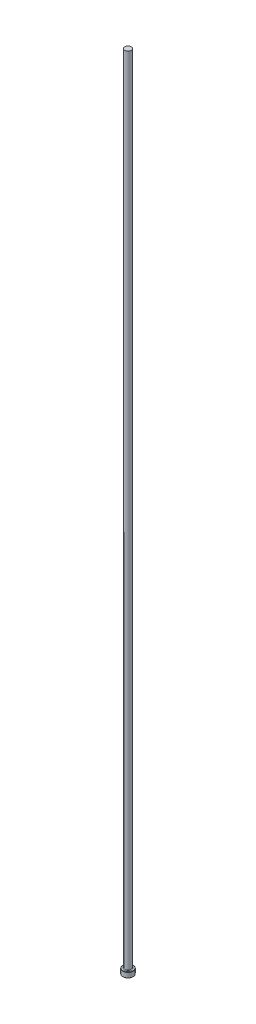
ISO-10303-21;
HEADER;
FILE_DESCRIPTION(('STEP AP214'),'2;1');
FILE_NAME('part.step','',(''),(''),'','','');
FILE_SCHEMA(('AUTOMOTIVE_DESIGN { 1 0 10303 214 1 1 1 1 }'));
ENDSEC;
DATA;
#1=APPLICATION_CONTEXT('core data for automotive mechanical design processes');
#2=APPLICATION_PROTOCOL_DEFINITION('international standard','automotive_design',2000,#1);
#3=PRODUCT_CONTEXT('',#1,'mechanical');
#4=PRODUCT('Part','Part','',(#3));
#5=PRODUCT_RELATED_PRODUCT_CATEGORY('part','',(#4));
#6=PRODUCT_DEFINITION_FORMATION('','',#4);
#7=PRODUCT_DEFINITION_CONTEXT('part definition',#1,'design');
#8=PRODUCT_DEFINITION('design','',#6,#7);
#9=PRODUCT_DEFINITION_SHAPE('','',#8);
#10=(LENGTH_UNIT() NAMED_UNIT(*) SI_UNIT(.MILLI.,.METRE.));
#11=(NAMED_UNIT(*) PLANE_ANGLE_UNIT() SI_UNIT($,.RADIAN.));
#12=(NAMED_UNIT(*) SI_UNIT($,.STERADIAN.) SOLID_ANGLE_UNIT());
#13=UNCERTAINTY_MEASURE_WITH_UNIT(LENGTH_MEASURE(1.E-05),#10,'distance_accuracy_value','');
#14=(GEOMETRIC_REPRESENTATION_CONTEXT(3) GLOBAL_UNCERTAINTY_ASSIGNED_CONTEXT((#13)) GLOBAL_UNIT_ASSIGNED_CONTEXT((#10,
#11,#12)) REPRESENTATION_CONTEXT('',''));
#15=CARTESIAN_POINT('',(0.,0.,0.));
#16=DIRECTION('',(0.,0.,1.));
#17=DIRECTION('',(1.,0.,0.));
#18=AXIS2_PLACEMENT_3D('',#15,#16,#17);
#19=CARTESIAN_POINT('',(0.,0.,0.));
#20=DIRECTION('',(0.,-1.,0.));
#21=DIRECTION('',(0.,0.,-1.));
#22=AXIS2_PLACEMENT_3D('',#19,#20,#21);
#23=PLANE('',#22);
#24=CARTESIAN_POINT('',(0.,0.,0.));
#25=DIRECTION('',(0.,-1.,0.));
#26=DIRECTION('',(0.,0.,-1.));
#27=AXIS2_PLACEMENT_3D('',#24,#25,#26);
#28=CIRCLE('',#27,6.09599999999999);
#29=CARTESIAN_POINT('',(0.,0.,-6.09599999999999));
#30=VERTEX_POINT('',#29);
#31=EDGE_CURVE('E41',#30,#30,#28,.T.);
#32=ORIENTED_EDGE('',*,*,#31,.T.);
#33=EDGE_LOOP('',(#32));
#34=FACE_BOUND('',#33,.T.);
#35=ADVANCED_FACE('F30',(#34),#23,.T.);
#36=CARTESIAN_POINT('',(0.,259.958771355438,0.));
#37=DIRECTION('',(0.,1.,0.));
#38=DIRECTION('',(0.,0.,1.));
#39=AXIS2_PLACEMENT_3D('',#36,#37,#38);
#40=CYLINDRICAL_SURFACE('',#39,6.34999999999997);
#41=CARTESIAN_POINT('',(0.,6.09599999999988,0.));
#42=DIRECTION('',(0.,1.,0.));
#43=DIRECTION('',(0.,0.,1.));
#44=AXIS2_PLACEMENT_3D('',#41,#42,#43);
#45=CIRCLE('',#44,6.34999999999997);
#46=CARTESIAN_POINT('',(0.,6.09599999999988,6.34999999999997));
#47=VERTEX_POINT('',#46);
#48=EDGE_CURVE('E45',#47,#47,#45,.F.);
#49=ORIENTED_EDGE('',*,*,#48,.T.);
#50=EDGE_LOOP('',(#49));
#51=FACE_BOUND('',#50,.T.);
#52=CARTESIAN_POINT('',(0.,0.253999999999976,0.));
#53=DIRECTION('',(0.,-1.,0.));
#54=DIRECTION('',(0.,0.,-1.));
#55=AXIS2_PLACEMENT_3D('',#52,#53,#54);
#56=CIRCLE('',#55,6.34999999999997);
#57=CARTESIAN_POINT('',(0.,0.253999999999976,-6.34999999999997));
#58=VERTEX_POINT('',#57);
#59=EDGE_CURVE('E50',#58,#58,#56,.F.);
#60=ORIENTED_EDGE('',*,*,#59,.T.);
#61=EDGE_LOOP('',(#60));
#62=FACE_BOUND('',#61,.T.);
#63=ADVANCED_FACE('F72',(#51,#62),#40,.T.);
#64=CARTESIAN_POINT('',(-6.34999999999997,6.35,0.));
#65=DIRECTION('',(0.,1.,0.));
#66=DIRECTION('',(0.,0.,1.));
#67=AXIS2_PLACEMENT_3D('',#64,#65,#66);
#68=PLANE('',#67);
#69=CARTESIAN_POINT('',(0.,6.35,0.));
#70=DIRECTION('',(0.,1.,0.));
#71=DIRECTION('',(0.,0.,1.));
#72=AXIS2_PLACEMENT_3D('',#69,#70,#71);
#73=CIRCLE('',#72,4.73074999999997);
#74=CARTESIAN_POINT('',(0.,6.35,4.73074999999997));
#75=VERTEX_POINT('',#74);
#76=EDGE_CURVE('E10',#75,#75,#73,.F.);
#77=ORIENTED_EDGE('',*,*,#76,.T.);
#78=EDGE_LOOP('',(#77));
#79=FACE_BOUND('',#78,.T.);
#80=CARTESIAN_POINT('',(0.,6.35,0.));
#81=DIRECTION('',(0.,1.,0.));
#82=DIRECTION('',(0.,0.,1.));
#83=AXIS2_PLACEMENT_3D('',#80,#81,#82);
#84=CIRCLE('',#83,6.0959999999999);
#85=CARTESIAN_POINT('',(0.,6.35,6.0959999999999));
#86=VERTEX_POINT('',#85);
#87=EDGE_CURVE('E53',#86,#86,#84,.T.);
#88=ORIENTED_EDGE('',*,*,#87,.T.);
#89=EDGE_LOOP('',(#88));
#90=FACE_BOUND('',#89,.T.);
#91=ADVANCED_FACE('F64',(#79,#90),#68,.T.);
#92=CARTESIAN_POINT('',(0.,259.958771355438,0.));
#93=DIRECTION('',(0.,1.,0.));
#94=DIRECTION('',(0.,0.,1.));
#95=AXIS2_PLACEMENT_3D('',#92,#93,#94);
#96=CYLINDRICAL_SURFACE('',#95,3.96874999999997);
#97=CARTESIAN_POINT('',(0.,7.11200000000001,0.));
#98=DIRECTION('',(0.,1.,0.));
#99=DIRECTION('',(0.,0.,1.));
#100=AXIS2_PLACEMENT_3D('',#97,#98,#99);
#101=CIRCLE('',#100,3.96874999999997);
#102=CARTESIAN_POINT('',(0.,7.11200000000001,3.96874999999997));
#103=VERTEX_POINT('',#102);
#104=EDGE_CURVE('E37',#103,#103,#101,.T.);
#105=ORIENTED_EDGE('',*,*,#104,.T.);
#106=EDGE_LOOP('',(#105));
#107=FACE_BOUND('',#106,.T.);
#108=CARTESIAN_POINT('',(0.,990.6,0.));
#109=DIRECTION('',(0.,1.,0.));
#110=DIRECTION('',(0.,0.,1.));
#111=AXIS2_PLACEMENT_3D('',#108,#109,#110);
#112=CIRCLE('',#111,3.96874999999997);
#113=CARTESIAN_POINT('',(0.,990.6,3.96874999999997));
#114=VERTEX_POINT('',#113);
#115=EDGE_CURVE('E56',#114,#114,#112,.T.);
#116=ORIENTED_EDGE('',*,*,#115,.F.);
#117=EDGE_LOOP('',(#116));
#118=FACE_BOUND('',#117,.T.);
#119=ADVANCED_FACE('F62',(#107,#118),#96,.T.);
#120=CARTESIAN_POINT('',(-3.96874999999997,990.6,0.));
#121=DIRECTION('',(0.,1.,0.));
#122=DIRECTION('',(0.,0.,1.));
#123=AXIS2_PLACEMENT_3D('',#120,#121,#122);
#124=PLANE('',#123);
#125=ORIENTED_EDGE('',*,*,#115,.T.);
#126=EDGE_LOOP('',(#125));
#127=FACE_BOUND('',#126,.T.);
#128=ADVANCED_FACE('F60',(#127),#124,.T.);
#129=CARTESIAN_POINT('',(0.,6.35000000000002,0.));
#130=DIRECTION('',(0.,-1.,0.));
#131=DIRECTION('',(0.,0.,-1.));
#132=AXIS2_PLACEMENT_3D('',#129,#130,#131);
#133=CONICAL_SURFACE('',#132,6.09599999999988,0.785398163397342);
#134=ORIENTED_EDGE('',*,*,#48,.F.);
#135=EDGE_LOOP('',(#134));
#136=FACE_BOUND('',#135,.T.);
#137=ORIENTED_EDGE('',*,*,#87,.F.);
#138=EDGE_LOOP('',(#137));
#139=FACE_BOUND('',#138,.T.);
#140=ADVANCED_FACE('F70',(#136,#139),#133,.T.);
#141=CARTESIAN_POINT('',(0.,0.253999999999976,0.));
#142=DIRECTION('',(0.,1.,0.));
#143=DIRECTION('',(0.,0.,1.));
#144=AXIS2_PLACEMENT_3D('',#141,#142,#143);
#145=CONICAL_SURFACE('',#144,6.34999999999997,0.785398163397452);
#146=ORIENTED_EDGE('',*,*,#31,.F.);
#147=EDGE_LOOP('',(#146));
#148=FACE_BOUND('',#147,.T.);
#149=ORIENTED_EDGE('',*,*,#59,.F.);
#150=EDGE_LOOP('',(#149));
#151=FACE_BOUND('',#150,.T.);
#152=ADVANCED_FACE('F84',(#148,#151),#145,.T.);
#153=CARTESIAN_POINT('',(0.,7.11200000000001,0.));
#154=DIRECTION('',(0.,1.,0.));
#155=DIRECTION('',(0.,0.,1.));
#156=AXIS2_PLACEMENT_3D('',#153,#154,#155);
#157=TOROIDAL_SURFACE('',#156,4.73074999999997,0.762);
#158=ORIENTED_EDGE('',*,*,#76,.F.);
#159=EDGE_LOOP('',(#158));
#160=FACE_BOUND('',#159,.T.);
#161=ORIENTED_EDGE('',*,*,#104,.F.);
#162=EDGE_LOOP('',(#161));
#163=FACE_BOUND('',#162,.T.);
#164=ADVANCED_FACE('F32',(#160,#163),#157,.F.);
#165=CLOSED_SHELL('',(#35,#63,#91,#119,#128,#140,#152,#164));
#166=MANIFOLD_SOLID_BREP('B2',#165);
#167=ADVANCED_BREP_SHAPE_REPRESENTATION('',(#18,#166),#14);
#168=SHAPE_DEFINITION_REPRESENTATION(#9,#167);
ENDSEC;
END-ISO-10303-21;
